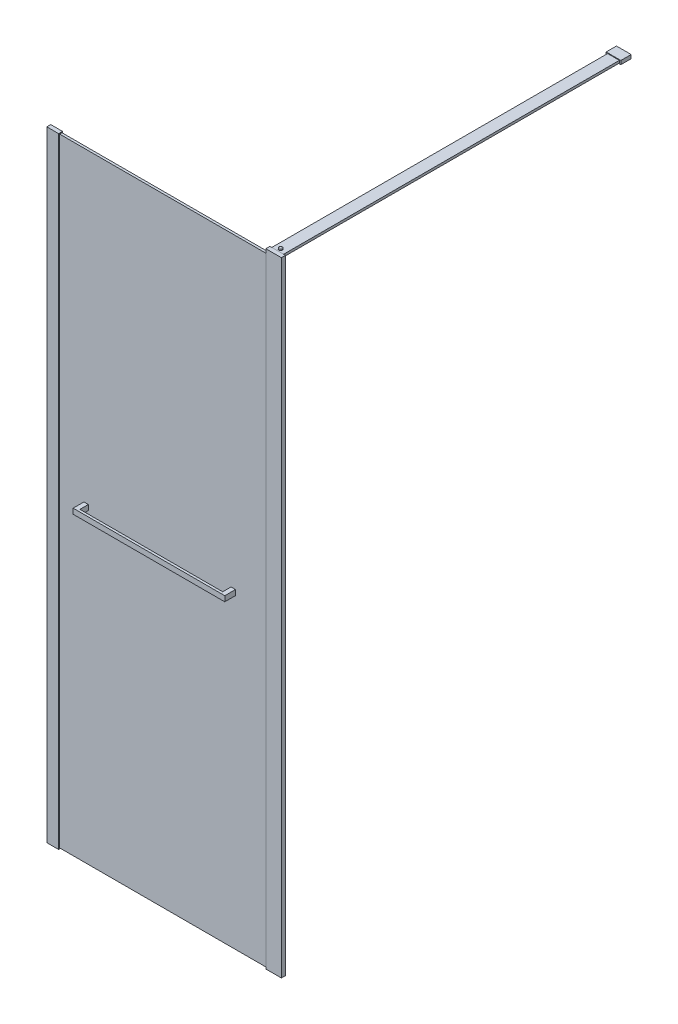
from build123d import *

# Parameters (mm, degrees)
DODANIE_WYCI_GNI_CIE1_START         = 3
DODANIE_WYCI_GNI_CIE1_DEPTH         = 2100
SZKIC2_W                            = 747
SZKIC2_H                            = 8
DODANIE_WYCI_GNI_CIE2_DEPTH         = 2100
DODANIE_WYCI_GNI_CIE3_DEPTH         = 2108
SZKIC4_W                            = 40
SZKIC4_H                            = 13.3
DODANIE_WYCI_GNI_CIE4_DEPTH         = 3
SZKIC5_W                            = 53
SZKIC5_H                            = 14
DODANIE_WYCI_GNI_CIE5_DEPTH         = 8
DODANIE_WYCI_GNI_CIE6_START         = -1.3
SZKIC6_W                            = 8.1
SZKIC6_H                            = 7.8
DODANIE_WYCI_GNI_CIE6_DEPTH         = 15
SZKIC7_W                            = 53
SZKIC7_H                            = 14
DODANIE_WYCI_GNI_CIE7_DEPTH         = 3
SZKIC8_W                            = 40
SZKIC8_H                            = 13.3
DODANIE_WYCI_GNI_CIE8_DEPTH         = 3
SZKIC9_W                            = 40
SZKIC9_H                            = 8
DODANIE_WYCI_GNI_CIE9_DEPTH         = 1170
DODANIE_WYCI_GNI_CIE10_START        = -29.4
SZKIC10_W                           = 50
SZKIC10_H                           = 12.5
DODANIE_WYCI_GNI_CIE10_DEPTH        = 35
DODANIE_WYCI_GNI_CIE11_DEPTH        = 36.5
DODANIE_WYCI_GNI_CIE11_DEPTH_BACK   = 18
SZKIC12_W                           = 15
SZKIC12_H                           = 18
DODANIE_WYCI_GNI_CIE11_2_DEPTH      = 36.5
DODANIE_WYCI_GNI_CIE11_2_DEPTH_BACK = 18
SZKIC13_W                           = 8
SZKIC13_H                           = 18
DODANIE_WYCI_GNI_CIE12_DEPTH        = 485


with BuildPart() as part:
    # Szkic1 → Dodanie-wyci_gni_cie1 (new body)
    with BuildSketch(Plane(origin=(0, 0, 0), x_dir=(1, 0, 0), z_dir=(0, 1, 0)).offset(DODANIE_WYCI_GNI_CIE1_START)):
        Polygon((0, 0), (0, 13.3), (40, 13.3), (40, 11.4), (6.5, 11.4), (6.5, 3.4), (40, 3.4), (40, 0), align=None)
    extrude(amount=DODANIE_WYCI_GNI_CIE1_DEPTH)

    # Szkic4 → Dodanie-wyci_gni_cie4 (add)
    with BuildSketch(Plane(origin=(0, 2103, 0), x_dir=(1, 0, 0), z_dir=(0, 1, 0))):
        with Locations((20, 6.65)):
            Rectangle(SZKIC4_W, SZKIC4_H)
    extrude(amount=DODANIE_WYCI_GNI_CIE4_DEPTH)

    # Szkic8 → Dodanie-wyci_gni_cie8 (add)
    with BuildSketch(Plane.XZ.offset(-3)):
        with Locations((20, -6.65)):
            Rectangle(SZKIC8_W, SZKIC8_H)
    extrude(amount=DODANIE_WYCI_GNI_CIE8_DEPTH)


with BuildPart() as body_2:
    # Szkic2 → Dodanie-wyci_gni_cie2 (new body)
    with BuildSketch(Plane.XZ.offset(-3)):
        with Locations((380, -7.4)):
            Rectangle(SZKIC2_W, SZKIC2_H)
    extrude(amount=-DODANIE_WYCI_GNI_CIE2_DEPTH)


with BuildPart() as body_3:
    # Szkic3 → Dodanie-wyci_gni_cie3 (new body)
    with BuildSketch(Plane.XZ.offset(-3)):
        Polygon((743.4, -3.4), (743.4, -0.4), (796.4, -0.4), (796.4, -14.4), (743.4, -14.4), (743.4, -11.4), (753.5, -11.4), (753.5, -3.4), align=None)
    extrude(amount=-DODANIE_WYCI_GNI_CIE3_DEPTH)

    # Szkic5 → Dodanie-wyci_gni_cie5 (add)
    with BuildSketch(Plane(origin=(0, 2111, 0), x_dir=(1, 0, 0), z_dir=(0, 1, 0))):
        with Locations((769.9, 7.4)):
            Rectangle(SZKIC5_W, SZKIC5_H)
    extrude(amount=DODANIE_WYCI_GNI_CIE5_DEPTH)

    # Szkic6 → Dodanie-wyci_gni_cie6 (add)
    with BuildSketch(Plane.ZY.offset(-743.4).offset(DODANIE_WYCI_GNI_CIE6_START)):
        with Locations((-7.4, 2107.1)):
            Rectangle(SZKIC6_W, SZKIC6_H)
    extrude(amount=-DODANIE_WYCI_GNI_CIE6_DEPTH)

    # Szkic7 → Dodanie-wyci_gni_cie7 (add)
    with BuildSketch(Plane.XZ.offset(-3)):
        with Locations((769.9, -7.4)):
            Rectangle(SZKIC7_W, SZKIC7_H)
    extrude(amount=DODANIE_WYCI_GNI_CIE7_DEPTH)


with BuildPart() as body_4:
    # Szkic9 → Dodanie-wyci_gni_cie9 (new body)
    with BuildSketch(Plane(origin=(0, 0, -14.4), x_dir=(-1, 0, 0), z_dir=(0, 0, -1))):
        with Locations((-769.9, 2115)):
            Rectangle(SZKIC9_W, SZKIC9_H)
    extrude(amount=DODANIE_WYCI_GNI_CIE9_DEPTH)

    # Szkic10 → Dodanie-wyci_gni_cie10 (add)
    with BuildSketch(Plane(origin=(0, 0, -1184.4), x_dir=(-1, 0, 0), z_dir=(0, 0, -1)).offset(DODANIE_WYCI_GNI_CIE10_START)):
        with Locations((-769.9, 2115)):
            Rectangle(SZKIC10_W, SZKIC10_H)
    extrude(amount=DODANIE_WYCI_GNI_CIE10_DEPTH)

    # Szkic11 → Obr_t1 (revolve)
    with BuildSketch(Plane(origin=(769.9, 0, 0), x_dir=(0, 0, -1), z_dir=(1, 0, 0))):
        with BuildLine():
            Line((30.3, 2119), (30.05, 2122.8))
            ThreePointArc((30.05, 2122.8), (27.38045718, 2124.212280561), (24.4, 2124.7))
            Line((24.4, 2124.7), (24.4, 2124.2))
            ThreePointArc((24.4, 2124.2), (27.113886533, 2123.773650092), (29.566308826, 2122.535676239))
            Line((29.566308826, 2122.535676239), (29.798919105, 2119))
            Line((29.798919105, 2119), (30.3, 2119))
        make_face()
    revolve(axis=Axis((769.9, 2119, -24.4), (0, 1, 0)))


with BuildPart() as body_5:
    # Szkic12 → Dodanie-wyci_gni_cie11 (new, two sides: drawn at the far end of the back side and taken through both)
    with BuildSketch(Plane.XY.offset(-3.4).offset(-DODANIE_WYCI_GNI_CIE11_DEPTH_BACK)):
        with Locations((130, 1053)):
            Rectangle(SZKIC12_W, SZKIC12_H)
    extrude(amount=DODANIE_WYCI_GNI_CIE11_DEPTH + DODANIE_WYCI_GNI_CIE11_DEPTH_BACK)



with BuildPart() as body_6:
    # Szkic12 → Dodanie-wyci_gni_cie11 2 (new, two sides: drawn at the far end of the back side and taken through both)
    with BuildSketch(Plane.XY.offset(-3.4).offset(-DODANIE_WYCI_GNI_CIE11_2_DEPTH_BACK)):
        with Locations((630, 1053)):
            Rectangle(SZKIC12_W, SZKIC12_H)
    extrude(amount=DODANIE_WYCI_GNI_CIE11_2_DEPTH + DODANIE_WYCI_GNI_CIE11_2_DEPTH_BACK)


with BuildPart() as body_5_1:
    add(body_5.part)

    add(body_6.part)  # Dodanie-wyci_gni_cie12 merges body 6
    # Szkic13 → Dodanie-wyci_gni_cie12 (add)
    with BuildSketch(Plane(origin=(137.5, 0, 0), x_dir=(0, 0, -1), z_dir=(1, 0, 0))):
        with Locations((-29.1, 1053)):
            Rectangle(SZKIC13_W, SZKIC13_H)
    extrude(amount=DODANIE_WYCI_GNI_CIE12_DEPTH)


solid = Compound([part.part, body_2.part, body_3.part, body_4.part, body_5_1.part])
